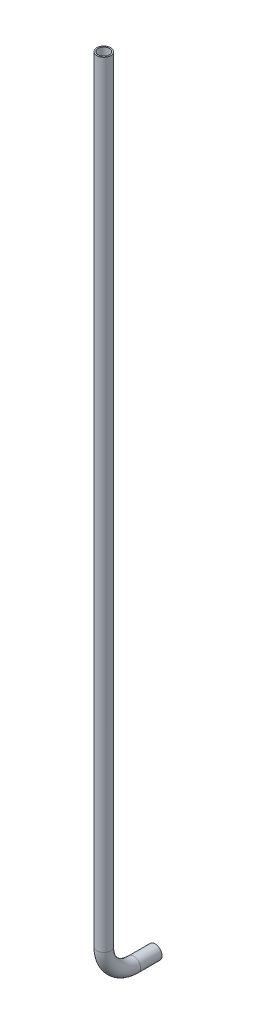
from build123d import *

# Parameters (mm, degrees)
SKETCH2_R   = 4.7625
SKETCH2_R_2 = 3.8735


with BuildPart() as part:
    # Sweep1: sweep along a path in Sketch1
    with BuildLine(Plane(origin=(0, 0, 0), x_dir=(0, 0, -1), z_dir=(1, 0, 0))) as sweep1_path:
        Line((0, 0), (-14.732, 0))
        ThreePointArc((-14.732, 0), (-29.324916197, 6.044583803), (-35.3695, 20.6375))
        Line((-35.3695, 20.6375), (-35.3695, 554.0375))
    # Sketch2 → Sweep1 (sweep)
    with BuildSketch(Plane.XY):
        Circle(SKETCH2_R)
        Circle(SKETCH2_R_2, mode=Mode.SUBTRACT)
    sweep(path=sweep1_path.line)


solid = part.part
